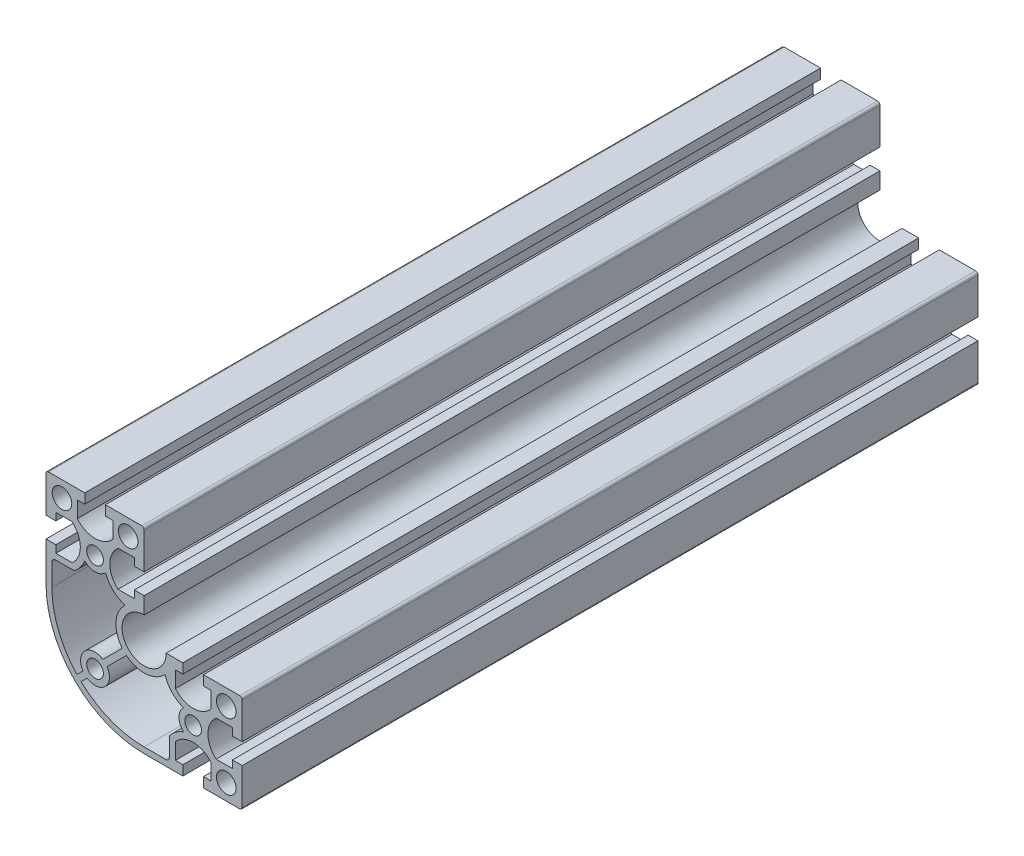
from build123d import *

# Parameters (mm, degrees)
SKETCH_1_R      = 3.4
SKETCH_1_R_2    = 4
EXTRUDE_1_DEPTH = 150


with BuildPart() as part:
    # Sketch 1 → Extrude 1 (new, symmetric)
    with BuildSketch(Plane.XY):
        with BuildLine():
            Line((36, -15.8), (40, -15.8))
            Line((40, -15.8), (40, -1))
            ThreePointArc((40, -1), (39.707106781, -0.292893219), (39, 0))
            Line((39, 0), (24.2, 0))
            Line((24.2, 0), (24.2, -4))
            Line((24.2, -4), (27.25, -4))
            Line((27.25, -4), (27.25, -10.639014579))
            ThreePointArc((27.25, -10.639014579), (20, -14), (12.75, -10.639014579))
            Line((12.75, -10.639014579), (12.75, -4))
            Line((12.75, -4), (15.8, -4))
            Line((15.8, -4), (15.8, 0))
            Line((15.8, 0), (9, 0))
            ThreePointArc((9, 0), (-6.363961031, -6.363961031), (0, 9))
            Line((0, 9), (0, 15.8))
            Line((0, 15.8), (-4, 15.8))
            Line((-4, 15.8), (-4, 12.75))
            Line((-4, 12.75), (-10.639014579, 12.75))
            ThreePointArc((-10.639014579, 12.75), (-14, 20), (-10.639014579, 27.25))
            Line((-10.639014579, 27.25), (-4, 27.25))
            Line((-4, 27.25), (-4, 24.2))
            Line((-4, 24.2), (0, 24.2))
            Line((0, 24.2), (0, 39))
            ThreePointArc((0, 39), (-0.292893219, 39.707106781), (-1, 40))
            Line((-1, 40), (-15.8, 40))
            Line((-15.8, 40), (-15.8, 36))
            Line((-15.8, 36), (-12.75, 36))
            Line((-12.75, 36), (-12.75, 29.360985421))
            ThreePointArc((-12.75, 29.360985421), (-20, 26), (-27.25, 29.360985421))
            Line((-27.25, 29.360985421), (-27.25, 36))
            Line((-27.25, 36), (-24.2, 36))
            Line((-24.2, 36), (-24.2, 40))
            Line((-24.2, 40), (-39, 40))
            ThreePointArc((-39, 40), (-39.707106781, 39.707106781), (-40, 39))
            Line((-40, 39), (-40, 24.2))
            Line((-40, 24.2), (-36, 24.2))
            Line((-36, 24.2), (-36, 27.25))
            Line((-36, 27.25), (-29.360985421, 27.25))
            ThreePointArc((-29.360985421, 27.25), (-26, 20), (-29.360985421, 12.75))
            Line((-29.360985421, 12.75), (-36, 12.75))
            Line((-36, 12.75), (-36, 15.8))
            Line((-36, 15.8), (-40, 15.8))
            Line((-40, 15.8), (-40, 0))
            ThreePointArc((-40, 0), (-28.284271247, -28.284271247), (0, -40))
            Line((0, -40), (15.8, -40))
            Line((15.8, -40), (15.8, -36))
            Line((15.8, -36), (12.75, -36))
            Line((12.75, -36), (12.75, -29.360985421))
            ThreePointArc((12.75, -29.360985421), (20, -26), (27.25, -29.360985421))
            Line((27.25, -29.360985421), (27.25, -36))
            Line((27.25, -36), (24.2, -36))
            Line((24.2, -36), (24.2, -40))
            Line((24.2, -40), (39, -40))
            ThreePointArc((39, -40), (39.707106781, -39.707106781), (40, -39))
            Line((40, -39), (40, -24.2))
            Line((40, -24.2), (36, -24.2))
            Line((36, -24.2), (36, -27.25))
            Line((36, -27.25), (29.360985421, -27.25))
            ThreePointArc((29.360985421, -27.25), (26, -20), (29.360985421, -12.75))
            Line((29.360985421, -12.75), (36, -12.75))
            Line((36, -12.75), (36, -15.8))
        make_face()
        with Locations((20, -20)):
            Circle(SKETCH_1_R, mode=Mode.SUBTRACT)
        with Locations((33.5, -33.5)):
            Circle(SKETCH_1_R_2, mode=Mode.SUBTRACT)
        with Locations((33.5, -6.5)):
            Circle(SKETCH_1_R_2, mode=Mode.SUBTRACT)
        with Locations((-6.5, 33.5)):
            Circle(SKETCH_1_R_2, mode=Mode.SUBTRACT)
        with Locations((-20, -20)):
            Circle(SKETCH_1_R, mode=Mode.SUBTRACT)
        with Locations((-33.5, 33.5)):
            Circle(SKETCH_1_R_2, mode=Mode.SUBTRACT)
        with Locations((-20, 20)):
            Circle(SKETCH_1_R, mode=Mode.SUBTRACT)
        with BuildLine():
            Line((10.35, -36.1), (10.35, -28.536703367))
            ThreePointArc((10.35, -28.536703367), (12.883101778, -25.962717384), (16.071656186, -24.267096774))
            ThreePointArc((16.071656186, -24.267096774), (14.2, -20), (16.071656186, -15.732903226))
            ThreePointArc((16.071656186, -15.732903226), (11.320850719, -12.64139839), (8.539114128, -7.702826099))
            ThreePointArc((8.539114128, -7.702826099), (0.895988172, -11.465042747), (-7.238807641, -8.935863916))
            Line((-7.238807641, -8.935863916), (-15.066744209, -16.763800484))
            ThreePointArc((-15.066744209, -16.763800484), (-15.828069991, -24.171930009), (-23.236199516, -24.933255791))
            Line((-23.236199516, -24.933255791), (-25.725143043, -27.422199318))
            ThreePointArc((-25.725143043, -27.422199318), (-13.83266615, -34.963085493), (0, -37.6))
            Line((0, -37.6), (8.85, -37.6))
            ThreePointArc((8.85, -37.6), (9.910660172, -37.160660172), (10.35, -36.1))
        make_face(mode=Mode.SUBTRACT)
        with BuildLine():
            Line((-28.536703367, 10.35), (-36.1, 10.35))
            ThreePointArc((-36.1, 10.35), (-37.160660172, 9.910660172), (-37.6, 8.85))
            Line((-37.6, 8.85), (-37.6, 0))
            ThreePointArc((-37.6, 0), (-34.963085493, -13.83266615), (-27.422199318, -25.725143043))
            Line((-27.422199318, -25.725143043), (-24.933255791, -23.236199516))
            ThreePointArc((-24.933255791, -23.236199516), (-24.171930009, -15.828069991), (-16.763800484, -15.066744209))
            Line((-16.763800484, -15.066744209), (-8.935863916, -7.238807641))
            ThreePointArc((-8.935863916, -7.238807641), (-11.465042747, 0.895988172), (-7.702826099, 8.539114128))
            ThreePointArc((-7.702826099, 8.539114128), (-12.64139839, 11.320850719), (-15.732903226, 16.071656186))
            ThreePointArc((-15.732903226, 16.071656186), (-20, 14.2), (-24.267096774, 16.071656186))
            ThreePointArc((-24.267096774, 16.071656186), (-25.962717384, 12.883101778), (-28.536703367, 10.35))
        make_face(mode=Mode.SUBTRACT)
    extrude(amount=EXTRUDE_1_DEPTH, both=True)


solid = part.part
